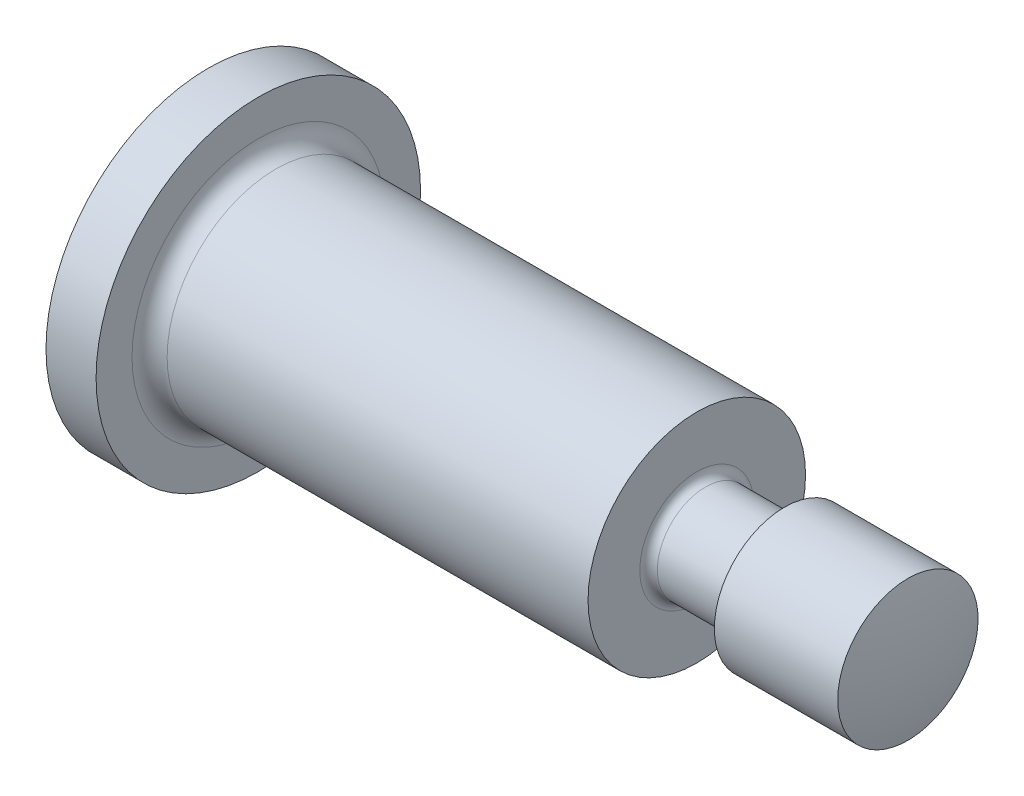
ISO-10303-21;
HEADER;
FILE_DESCRIPTION(('STEP AP214'),'2;1');
FILE_NAME('part.step','',(''),(''),'','','');
FILE_SCHEMA(('AUTOMOTIVE_DESIGN { 1 0 10303 214 1 1 1 1 }'));
ENDSEC;
DATA;
#1=APPLICATION_CONTEXT('core data for automotive mechanical design processes');
#2=APPLICATION_PROTOCOL_DEFINITION('international standard','automotive_design',2000,#1);
#3=PRODUCT_CONTEXT('',#1,'mechanical');
#4=PRODUCT('Part','Part','',(#3));
#5=PRODUCT_RELATED_PRODUCT_CATEGORY('part','',(#4));
#6=PRODUCT_DEFINITION_FORMATION('','',#4);
#7=PRODUCT_DEFINITION_CONTEXT('part definition',#1,'design');
#8=PRODUCT_DEFINITION('design','',#6,#7);
#9=PRODUCT_DEFINITION_SHAPE('','',#8);
#10=(LENGTH_UNIT() NAMED_UNIT(*) SI_UNIT(.MILLI.,.METRE.));
#11=(NAMED_UNIT(*) PLANE_ANGLE_UNIT() SI_UNIT($,.RADIAN.));
#12=(NAMED_UNIT(*) SI_UNIT($,.STERADIAN.) SOLID_ANGLE_UNIT());
#13=UNCERTAINTY_MEASURE_WITH_UNIT(LENGTH_MEASURE(1.E-05),#10,'distance_accuracy_value','');
#14=(GEOMETRIC_REPRESENTATION_CONTEXT(3) GLOBAL_UNCERTAINTY_ASSIGNED_CONTEXT((#13)) GLOBAL_UNIT_ASSIGNED_CONTEXT((#10,
#11,#12)) REPRESENTATION_CONTEXT('',''));
#15=CARTESIAN_POINT('',(0.,0.,0.));
#16=DIRECTION('',(0.,0.,1.));
#17=DIRECTION('',(1.,0.,0.));
#18=AXIS2_PLACEMENT_3D('',#15,#16,#17);
#19=CARTESIAN_POINT('',(6.10000000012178,0.,0.));
#20=DIRECTION('',(1.,0.,0.));
#21=DIRECTION('',(0.,0.,-1.));
#22=AXIS2_PLACEMENT_3D('',#19,#20,#21);
#23=PLANE('',#22);
#24=CARTESIAN_POINT('',(6.10000000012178,0.,0.));
#25=DIRECTION('',(1.,0.,0.));
#26=DIRECTION('',(0.,0.,-1.));
#27=AXIS2_PLACEMENT_3D('',#24,#25,#26);
#28=CIRCLE('',#27,0.65);
#29=CARTESIAN_POINT('',(6.10000000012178,0.,-0.65));
#30=VERTEX_POINT('',#29);
#31=EDGE_CURVE('E80',#30,#30,#28,.F.);
#32=ORIENTED_EDGE('',*,*,#31,.T.);
#33=EDGE_LOOP('',(#32));
#34=FACE_BOUND('',#33,.T.);
#35=CARTESIAN_POINT('',(6.10000000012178,0.,0.));
#36=DIRECTION('',(1.,0.,0.));
#37=DIRECTION('',(0.,0.,-1.));
#38=AXIS2_PLACEMENT_3D('',#35,#36,#37);
#39=CIRCLE('',#38,1.24);
#40=CARTESIAN_POINT('',(6.10000000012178,0.,-1.24));
#41=VERTEX_POINT('',#40);
#42=EDGE_CURVE('E91',#41,#41,#39,.T.);
#43=ORIENTED_EDGE('',*,*,#42,.T.);
#44=EDGE_LOOP('',(#43));
#45=FACE_BOUND('',#44,.T.);
#46=ADVANCED_FACE('F43',(#34,#45),#23,.T.);
#47=CARTESIAN_POINT('',(1.1,0.,0.));
#48=DIRECTION('',(1.,0.,0.));
#49=DIRECTION('',(0.,0.,-1.));
#50=AXIS2_PLACEMENT_3D('',#47,#48,#49);
#51=PLANE('',#50);
#52=CARTESIAN_POINT('',(1.1,0.,0.));
#53=DIRECTION('',(1.,0.,0.));
#54=DIRECTION('',(0.,0.,-1.));
#55=AXIS2_PLACEMENT_3D('',#52,#53,#54);
#56=CIRCLE('',#55,1.44);
#57=CARTESIAN_POINT('',(1.1,0.,-1.44));
#58=VERTEX_POINT('',#57);
#59=EDGE_CURVE('E11',#58,#58,#56,.F.);
#60=ORIENTED_EDGE('',*,*,#59,.T.);
#61=EDGE_LOOP('',(#60));
#62=FACE_BOUND('',#61,.T.);
#63=CARTESIAN_POINT('',(1.1,0.,0.));
#64=DIRECTION('',(1.,0.,0.));
#65=DIRECTION('',(0.,0.,-1.));
#66=AXIS2_PLACEMENT_3D('',#63,#64,#65);
#67=CIRCLE('',#66,1.85);
#68=CARTESIAN_POINT('',(1.1,0.,-1.85));
#69=VERTEX_POINT('',#68);
#70=EDGE_CURVE('E100',#69,#69,#67,.T.);
#71=ORIENTED_EDGE('',*,*,#70,.T.);
#72=EDGE_LOOP('',(#71));
#73=FACE_BOUND('',#72,.T.);
#74=ADVANCED_FACE('F132',(#62,#73),#51,.T.);
#75=CARTESIAN_POINT('',(1.1,0.,0.));
#76=DIRECTION('',(-1.,0.,0.));
#77=DIRECTION('',(0.,0.,1.));
#78=AXIS2_PLACEMENT_3D('',#75,#76,#77);
#79=CYLINDRICAL_SURFACE('',#78,1.85);
#80=CARTESIAN_POINT('',(0.528889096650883,0.,0.));
#81=DIRECTION('',(1.,0.,0.));
#82=DIRECTION('',(0.,1.,0.));
#83=AXIS2_PLACEMENT_3D('',#80,#81,#82);
#84=CIRCLE('',#83,1.85);
#85=CARTESIAN_POINT('',(0.528889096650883,1.85,0.));
#86=VERTEX_POINT('',#85);
#87=EDGE_CURVE('E190',#86,#86,#84,.T.);
#88=ORIENTED_EDGE('',*,*,#87,.T.);
#89=EDGE_LOOP('',(#88));
#90=FACE_BOUND('',#89,.T.);
#91=ORIENTED_EDGE('',*,*,#70,.F.);
#92=EDGE_LOOP('',(#91));
#93=FACE_BOUND('',#92,.T.);
#94=ADVANCED_FACE('F139',(#90,#93),#79,.T.);
#95=CARTESIAN_POINT('',(6.10000000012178,0.,0.));
#96=DIRECTION('',(-1.,0.,0.));
#97=DIRECTION('',(0.,0.,1.));
#98=AXIS2_PLACEMENT_3D('',#95,#96,#97);
#99=CYLINDRICAL_SURFACE('',#98,1.24);
#100=CARTESIAN_POINT('',(1.3,0.,0.));
#101=DIRECTION('',(1.,0.,0.));
#102=DIRECTION('',(0.,0.,-1.));
#103=AXIS2_PLACEMENT_3D('',#100,#101,#102);
#104=CIRCLE('',#103,1.24);
#105=CARTESIAN_POINT('',(1.3,0.,-1.24));
#106=VERTEX_POINT('',#105);
#107=EDGE_CURVE('E51',#106,#106,#104,.T.);
#108=ORIENTED_EDGE('',*,*,#107,.T.);
#109=EDGE_LOOP('',(#108));
#110=FACE_BOUND('',#109,.T.);
#111=ORIENTED_EDGE('',*,*,#42,.F.);
#112=EDGE_LOOP('',(#111));
#113=FACE_BOUND('',#112,.T.);
#114=ADVANCED_FACE('F118',(#110,#113),#99,.T.);
#115=CARTESIAN_POINT('',(7.10000000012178,5.55,0.));
#116=DIRECTION('',(1.,0.,0.));
#117=DIRECTION('',(0.,1.,0.));
#118=AXIS2_PLACEMENT_3D('',#115,#116,#117);
#119=PLANE('',#118);
#120=CARTESIAN_POINT('',(7.10000000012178,0.,0.));
#121=DIRECTION('',(1.,0.,0.));
#122=DIRECTION('',(0.,1.,0.));
#123=AXIS2_PLACEMENT_3D('',#120,#121,#122);
#124=CIRCLE('',#123,0.65);
#125=CARTESIAN_POINT('',(7.10000000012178,0.650000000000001,0.));
#126=VERTEX_POINT('',#125);
#127=EDGE_CURVE('E105',#126,#126,#124,.T.);
#128=ORIENTED_EDGE('',*,*,#127,.T.);
#129=EDGE_LOOP('',(#128));
#130=FACE_BOUND('',#129,.T.);
#131=CARTESIAN_POINT('',(7.10000000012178,0.,0.));
#132=DIRECTION('',(1.,0.,0.));
#133=DIRECTION('',(0.,1.,0.));
#134=AXIS2_PLACEMENT_3D('',#131,#132,#133);
#135=CIRCLE('',#134,0.8);
#136=CARTESIAN_POINT('',(7.10000000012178,0.8,0.));
#137=VERTEX_POINT('',#136);
#138=EDGE_CURVE('E89',#137,#137,#135,.T.);
#139=ORIENTED_EDGE('',*,*,#138,.F.);
#140=EDGE_LOOP('',(#139));
#141=FACE_BOUND('',#140,.T.);
#142=ADVANCED_FACE('F148',(#130,#141),#119,.F.);
#143=CARTESIAN_POINT('',(2.42799480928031,0.,0.));
#144=DIRECTION('',(1.,0.,0.));
#145=DIRECTION('',(0.,1.,0.));
#146=AXIS2_PLACEMENT_3D('',#143,#144,#145);
#147=CYLINDRICAL_SURFACE('',#146,0.55);
#148=CARTESIAN_POINT('',(7.00000000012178,0.,0.));
#149=DIRECTION('',(1.,0.,0.));
#150=DIRECTION('',(0.,1.,0.));
#151=AXIS2_PLACEMENT_3D('',#148,#149,#150);
#152=CIRCLE('',#151,0.55);
#153=CARTESIAN_POINT('',(7.00000000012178,0.550000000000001,0.));
#154=VERTEX_POINT('',#153);
#155=EDGE_CURVE('E110',#154,#154,#152,.F.);
#156=ORIENTED_EDGE('',*,*,#155,.T.);
#157=EDGE_LOOP('',(#156));
#158=FACE_BOUND('',#157,.T.);
#159=CARTESIAN_POINT('',(6.20000000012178,0.,0.));
#160=DIRECTION('',(1.,0.,0.));
#161=DIRECTION('',(0.,0.,-1.));
#162=AXIS2_PLACEMENT_3D('',#159,#160,#161);
#163=CIRCLE('',#162,0.55);
#164=CARTESIAN_POINT('',(6.20000000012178,0.,-0.55));
#165=VERTEX_POINT('',#164);
#166=EDGE_CURVE('E108',#165,#165,#163,.T.);
#167=ORIENTED_EDGE('',*,*,#166,.T.);
#168=EDGE_LOOP('',(#167));
#169=FACE_BOUND('',#168,.T.);
#170=ADVANCED_FACE('F166',(#158,#169),#147,.T.);
#171=CARTESIAN_POINT('',(8.60000000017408,0.,0.));
#172=DIRECTION('',(-1.,0.,0.));
#173=DIRECTION('',(0.,0.,1.));
#174=AXIS2_PLACEMENT_3D('',#171,#172,#173);
#175=CYLINDRICAL_SURFACE('',#174,0.8);
#176=CARTESIAN_POINT('',(8.50734500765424,0.,0.));
#177=DIRECTION('',(-1.,0.,0.));
#178=DIRECTION('',(0.,0.,1.));
#179=AXIS2_PLACEMENT_3D('',#176,#177,#178);
#180=CIRCLE('',#179,0.8);
#181=CARTESIAN_POINT('',(8.50734500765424,0.,0.8));
#182=VERTEX_POINT('',#181);
#183=EDGE_CURVE('E92',#182,#182,#180,.T.);
#184=ORIENTED_EDGE('',*,*,#183,.T.);
#185=EDGE_LOOP('',(#184));
#186=FACE_BOUND('',#185,.T.);
#187=ORIENTED_EDGE('',*,*,#138,.T.);
#188=EDGE_LOOP('',(#187));
#189=FACE_BOUND('',#188,.T.);
#190=ADVANCED_FACE('F143',(#186,#189),#175,.T.);
#191=CARTESIAN_POINT('',(7.00000000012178,0.,0.));
#192=DIRECTION('',(1.,0.,0.));
#193=DIRECTION('',(0.,1.,0.));
#194=AXIS2_PLACEMENT_3D('',#191,#192,#193);
#195=TOROIDAL_SURFACE('',#194,0.65,0.1);
#196=ORIENTED_EDGE('',*,*,#155,.F.);
#197=EDGE_LOOP('',(#196));
#198=FACE_BOUND('',#197,.T.);
#199=ORIENTED_EDGE('',*,*,#127,.F.);
#200=EDGE_LOOP('',(#199));
#201=FACE_BOUND('',#200,.T.);
#202=ADVANCED_FACE('F153',(#198,#201),#195,.F.);
#203=CARTESIAN_POINT('',(6.20000000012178,0.,0.));
#204=DIRECTION('',(1.,0.,0.));
#205=DIRECTION('',(0.,0.,-1.));
#206=AXIS2_PLACEMENT_3D('',#203,#204,#205);
#207=TOROIDAL_SURFACE('',#206,0.65,0.1);
#208=ORIENTED_EDGE('',*,*,#31,.F.);
#209=EDGE_LOOP('',(#208));
#210=FACE_BOUND('',#209,.T.);
#211=ORIENTED_EDGE('',*,*,#166,.F.);
#212=EDGE_LOOP('',(#211));
#213=FACE_BOUND('',#212,.T.);
#214=ADVANCED_FACE('F151',(#210,#213),#207,.F.);
#215=CARTESIAN_POINT('',(5.10000000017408,0.,0.));
#216=DIRECTION('',(1.,0.,0.));
#217=DIRECTION('',(0.,1.,0.));
#218=AXIS2_PLACEMENT_3D('',#215,#216,#217);
#219=SPHERICAL_SURFACE('',#218,3.5);
#220=CARTESIAN_POINT('',(8.60000000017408,0.,0.));
#221=VERTEX_POINT('',#220);
#222=VERTEX_LOOP('',#221);
#223=FACE_BOUND('',#222,.T.);
#224=ORIENTED_EDGE('',*,*,#183,.F.);
#225=EDGE_LOOP('',(#224));
#226=FACE_BOUND('',#225,.T.);
#227=ADVANCED_FACE('F157',(#223,#226),#219,.T.);
#228=CARTESIAN_POINT('',(3.5,0.,0.));
#229=DIRECTION('',(1.,0.,0.));
#230=DIRECTION('',(0.,1.,0.));
#231=AXIS2_PLACEMENT_3D('',#228,#229,#230);
#232=SPHERICAL_SURFACE('',#231,3.5);
#233=ORIENTED_EDGE('',*,*,#87,.F.);
#234=EDGE_LOOP('',(#233));
#235=FACE_BOUND('',#234,.T.);
#236=CARTESIAN_POINT('',(0.5,0.,0.));
#237=DIRECTION('',(1.,0.,0.));
#238=DIRECTION('',(0.,0.,-1.));
#239=AXIS2_PLACEMENT_3D('',#236,#237,#238);
#240=CIRCLE('',#239,1.802775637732);
#241=CARTESIAN_POINT('',(0.5,0.25,-1.78535710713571));
#242=VERTEX_POINT('',#241);
#243=CARTESIAN_POINT('',(0.5,-0.25,-1.78535710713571));
#244=VERTEX_POINT('',#243);
#245=EDGE_CURVE('E59',#242,#244,#240,.F.);
#246=ORIENTED_EDGE('',*,*,#245,.F.);
#247=CARTESIAN_POINT('',(3.5,0.250000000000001,0.));
#248=DIRECTION('',(0.,1.,0.));
#249=DIRECTION('',(-1.,0.,0.));
#250=AXIS2_PLACEMENT_3D('',#247,#248,#249);
#251=CIRCLE('',#250,3.49106001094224);
#252=CARTESIAN_POINT('',(0.5,0.25,1.78535710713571));
#253=VERTEX_POINT('',#252);
#254=EDGE_CURVE('E68',#253,#242,#251,.F.);
#255=ORIENTED_EDGE('',*,*,#254,.F.);
#256=CARTESIAN_POINT('',(0.5,-0.25,1.78535710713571));
#257=VERTEX_POINT('',#256);
#258=EDGE_CURVE('E74',#257,#253,#240,.F.);
#259=ORIENTED_EDGE('',*,*,#258,.F.);
#260=CARTESIAN_POINT('',(3.5,-0.249999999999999,0.));
#261=DIRECTION('',(0.,-1.,0.));
#262=DIRECTION('',(1.,0.,0.));
#263=AXIS2_PLACEMENT_3D('',#260,#261,#262);
#264=CIRCLE('',#263,3.49106001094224);
#265=EDGE_CURVE('E83',#244,#257,#264,.F.);
#266=ORIENTED_EDGE('',*,*,#265,.F.);
#267=EDGE_LOOP('',(#246,#255,#259,#266));
#268=FACE_BOUND('',#267,.T.);
#269=ADVANCED_FACE('F73',(#235,#268),#232,.T.);
#270=CARTESIAN_POINT('',(0.,0.25,-1.85));
#271=DIRECTION('',(0.,1.,0.));
#272=DIRECTION('',(-1.,0.,0.));
#273=AXIS2_PLACEMENT_3D('',#270,#271,#272);
#274=PLANE('',#273);
#275=DIRECTION('',(0.,0.,1.));
#276=VECTOR('',#275,1.);
#277=CARTESIAN_POINT('',(0.5,0.25,-1.85));
#278=LINE('',#277,#276);
#279=EDGE_CURVE('E85',#242,#253,#278,.T.);
#280=ORIENTED_EDGE('',*,*,#279,.T.);
#281=ORIENTED_EDGE('',*,*,#254,.T.);
#282=EDGE_LOOP('',(#280,#281));
#283=FACE_BOUND('',#282,.T.);
#284=ADVANCED_FACE('F90',(#283),#274,.F.);
#285=CARTESIAN_POINT('',(0.,-0.25,-1.85));
#286=DIRECTION('',(0.,-1.,0.));
#287=DIRECTION('',(1.,0.,0.));
#288=AXIS2_PLACEMENT_3D('',#285,#286,#287);
#289=PLANE('',#288);
#290=DIRECTION('',(0.,0.,1.));
#291=VECTOR('',#290,1.);
#292=CARTESIAN_POINT('',(0.5,-0.25,-1.85));
#293=LINE('',#292,#291);
#294=EDGE_CURVE('E84',#244,#257,#293,.T.);
#295=ORIENTED_EDGE('',*,*,#294,.F.);
#296=ORIENTED_EDGE('',*,*,#265,.T.);
#297=EDGE_LOOP('',(#295,#296));
#298=FACE_BOUND('',#297,.T.);
#299=ADVANCED_FACE('F130',(#298),#289,.F.);
#300=CARTESIAN_POINT('',(0.5,-0.25,-1.85));
#301=DIRECTION('',(1.,0.,0.));
#302=DIRECTION('',(0.,0.,-1.));
#303=AXIS2_PLACEMENT_3D('',#300,#301,#302);
#304=PLANE('',#303);
#305=ORIENTED_EDGE('',*,*,#294,.T.);
#306=ORIENTED_EDGE('',*,*,#258,.T.);
#307=ORIENTED_EDGE('',*,*,#279,.F.);
#308=ORIENTED_EDGE('',*,*,#245,.T.);
#309=EDGE_LOOP('',(#305,#306,#307,#308));
#310=FACE_BOUND('',#309,.T.);
#311=ADVANCED_FACE('F82',(#310),#304,.F.);
#312=CARTESIAN_POINT('',(1.3,0.,0.));
#313=DIRECTION('',(1.,0.,0.));
#314=DIRECTION('',(0.,0.,-1.));
#315=AXIS2_PLACEMENT_3D('',#312,#313,#314);
#316=TOROIDAL_SURFACE('',#315,1.44,0.2);
#317=ORIENTED_EDGE('',*,*,#59,.F.);
#318=EDGE_LOOP('',(#317));
#319=FACE_BOUND('',#318,.T.);
#320=ORIENTED_EDGE('',*,*,#107,.F.);
#321=EDGE_LOOP('',(#320));
#322=FACE_BOUND('',#321,.T.);
#323=ADVANCED_FACE('F44',(#319,#322),#316,.F.);
#324=CLOSED_SHELL('',(#46,#74,#94,#114,#142,#170,#190,#202,#214,#227,#269,#284,#299,#311,#323));
#325=MANIFOLD_SOLID_BREP('B2',#324);
#326=ADVANCED_BREP_SHAPE_REPRESENTATION('',(#18,#325),#14);
#327=SHAPE_DEFINITION_REPRESENTATION(#9,#326);
ENDSEC;
END-ISO-10303-21;
